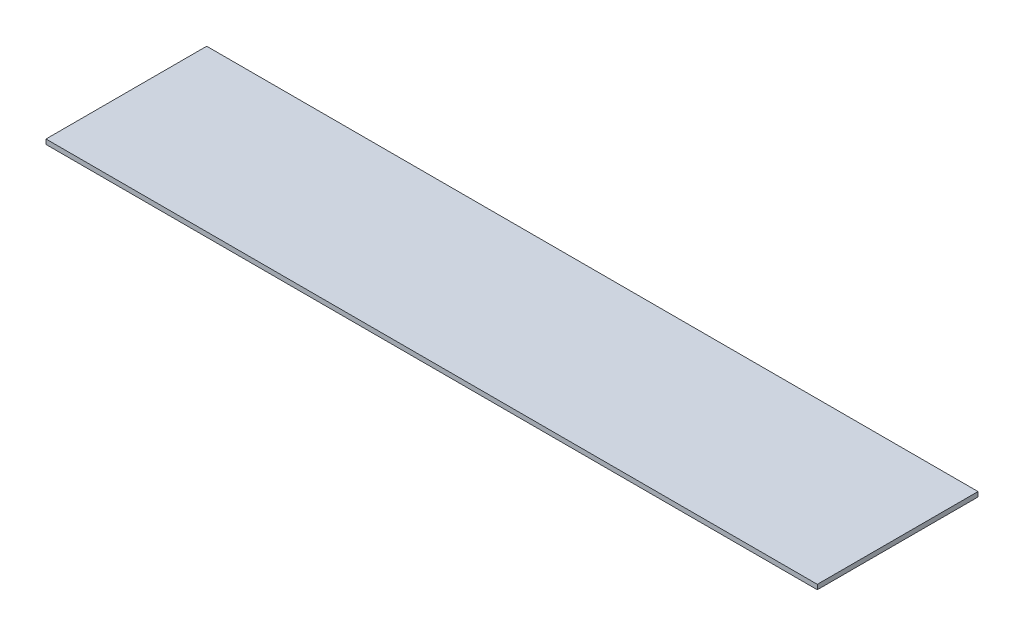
ISO-10303-21;
HEADER;
FILE_DESCRIPTION(('STEP AP214'),'2;1');
FILE_NAME('part.step','',(''),(''),'','','');
FILE_SCHEMA(('AUTOMOTIVE_DESIGN { 1 0 10303 214 1 1 1 1 }'));
ENDSEC;
DATA;
#1=APPLICATION_CONTEXT('core data for automotive mechanical design processes');
#2=APPLICATION_PROTOCOL_DEFINITION('international standard','automotive_design',2000,#1);
#3=PRODUCT_CONTEXT('',#1,'mechanical');
#4=PRODUCT('Part','Part','',(#3));
#5=PRODUCT_RELATED_PRODUCT_CATEGORY('part','',(#4));
#6=PRODUCT_DEFINITION_FORMATION('','',#4);
#7=PRODUCT_DEFINITION_CONTEXT('part definition',#1,'design');
#8=PRODUCT_DEFINITION('design','',#6,#7);
#9=PRODUCT_DEFINITION_SHAPE('','',#8);
#10=(LENGTH_UNIT() NAMED_UNIT(*) SI_UNIT(.MILLI.,.METRE.));
#11=(NAMED_UNIT(*) PLANE_ANGLE_UNIT() SI_UNIT($,.RADIAN.));
#12=(NAMED_UNIT(*) SI_UNIT($,.STERADIAN.) SOLID_ANGLE_UNIT());
#13=UNCERTAINTY_MEASURE_WITH_UNIT(LENGTH_MEASURE(1.E-05),#10,'distance_accuracy_value','');
#14=(GEOMETRIC_REPRESENTATION_CONTEXT(3) GLOBAL_UNCERTAINTY_ASSIGNED_CONTEXT((#13)) GLOBAL_UNIT_ASSIGNED_CONTEXT((#10,
#11,#12)) REPRESENTATION_CONTEXT('',''));
#15=CARTESIAN_POINT('',(0.,0.,0.));
#16=DIRECTION('',(0.,0.,1.));
#17=DIRECTION('',(1.,0.,0.));
#18=AXIS2_PLACEMENT_3D('',#15,#16,#17);
#19=CARTESIAN_POINT('',(0.,3.,0.));
#20=DIRECTION('',(1.,0.,0.));
#21=DIRECTION('',(0.,0.,-1.));
#22=AXIS2_PLACEMENT_3D('',#19,#20,#21);
#23=PLANE('',#22);
#24=DIRECTION('',(0.,0.,1.));
#25=VECTOR('',#24,1.);
#26=CARTESIAN_POINT('',(0.,0.,0.));
#27=LINE('',#26,#25);
#28=CARTESIAN_POINT('',(0.,0.,-101.6));
#29=VERTEX_POINT('',#28);
#30=CARTESIAN_POINT('',(0.,0.,0.));
#31=VERTEX_POINT('',#30);
#32=EDGE_CURVE('E96',#29,#31,#27,.T.);
#33=ORIENTED_EDGE('',*,*,#32,.T.);
#34=DIRECTION('',(0.,-1.,0.));
#35=VECTOR('',#34,1.);
#36=CARTESIAN_POINT('',(0.,3.,0.));
#37=LINE('',#36,#35);
#38=CARTESIAN_POINT('',(0.,3.,0.));
#39=VERTEX_POINT('',#38);
#40=EDGE_CURVE('E11',#39,#31,#37,.T.);
#41=ORIENTED_EDGE('',*,*,#40,.F.);
#42=DIRECTION('',(0.,0.,1.));
#43=VECTOR('',#42,1.);
#44=CARTESIAN_POINT('',(0.,3.,0.));
#45=LINE('',#44,#43);
#46=CARTESIAN_POINT('',(0.,3.,-101.6));
#47=VERTEX_POINT('',#46);
#48=EDGE_CURVE('E84',#47,#39,#45,.T.);
#49=ORIENTED_EDGE('',*,*,#48,.F.);
#50=DIRECTION('',(0.,-1.,0.));
#51=VECTOR('',#50,1.);
#52=CARTESIAN_POINT('',(0.,3.,-101.6));
#53=LINE('',#52,#51);
#54=EDGE_CURVE('E92',#47,#29,#53,.T.);
#55=ORIENTED_EDGE('',*,*,#54,.T.);
#56=EDGE_LOOP('',(#33,#41,#49,#55));
#57=FACE_BOUND('',#56,.T.);
#58=ADVANCED_FACE('F33',(#57),#23,.F.);
#59=CARTESIAN_POINT('',(0.,3.,0.));
#60=DIRECTION('',(0.,0.,-1.));
#61=DIRECTION('',(-1.,0.,0.));
#62=AXIS2_PLACEMENT_3D('',#59,#60,#61);
#63=PLANE('',#62);
#64=DIRECTION('',(1.,0.,0.));
#65=VECTOR('',#64,1.);
#66=CARTESIAN_POINT('',(0.,0.,0.));
#67=LINE('',#66,#65);
#68=CARTESIAN_POINT('',(487.68,0.,0.));
#69=VERTEX_POINT('',#68);
#70=EDGE_CURVE('E88',#31,#69,#67,.T.);
#71=ORIENTED_EDGE('',*,*,#70,.T.);
#72=DIRECTION('',(0.,-1.,0.));
#73=VECTOR('',#72,1.);
#74=CARTESIAN_POINT('',(487.68,3.,0.));
#75=LINE('',#74,#73);
#76=CARTESIAN_POINT('',(487.68,3.,0.));
#77=VERTEX_POINT('',#76);
#78=EDGE_CURVE('E41',#77,#69,#75,.T.);
#79=ORIENTED_EDGE('',*,*,#78,.F.);
#80=DIRECTION('',(1.,0.,0.));
#81=VECTOR('',#80,1.);
#82=CARTESIAN_POINT('',(0.,3.,0.));
#83=LINE('',#82,#81);
#84=EDGE_CURVE('E79',#39,#77,#83,.T.);
#85=ORIENTED_EDGE('',*,*,#84,.F.);
#86=ORIENTED_EDGE('',*,*,#40,.T.);
#87=EDGE_LOOP('',(#71,#79,#85,#86));
#88=FACE_BOUND('',#87,.T.);
#89=ADVANCED_FACE('F87',(#88),#63,.F.);
#90=CARTESIAN_POINT('',(487.68,3.,0.));
#91=DIRECTION('',(-1.,0.,0.));
#92=DIRECTION('',(0.,0.,1.));
#93=AXIS2_PLACEMENT_3D('',#90,#91,#92);
#94=PLANE('',#93);
#95=DIRECTION('',(0.,0.,-1.));
#96=VECTOR('',#95,1.);
#97=CARTESIAN_POINT('',(487.68,0.,0.));
#98=LINE('',#97,#96);
#99=CARTESIAN_POINT('',(487.68,0.,-101.6));
#100=VERTEX_POINT('',#99);
#101=EDGE_CURVE('E66',#69,#100,#98,.T.);
#102=ORIENTED_EDGE('',*,*,#101,.T.);
#103=DIRECTION('',(0.,-1.,0.));
#104=VECTOR('',#103,1.);
#105=CARTESIAN_POINT('',(487.68,3.,-101.6));
#106=LINE('',#105,#104);
#107=CARTESIAN_POINT('',(487.68,3.,-101.6));
#108=VERTEX_POINT('',#107);
#109=EDGE_CURVE('E89',#108,#100,#106,.T.);
#110=ORIENTED_EDGE('',*,*,#109,.F.);
#111=DIRECTION('',(0.,0.,-1.));
#112=VECTOR('',#111,1.);
#113=CARTESIAN_POINT('',(487.68,3.,0.));
#114=LINE('',#113,#112);
#115=EDGE_CURVE('E82',#77,#108,#114,.T.);
#116=ORIENTED_EDGE('',*,*,#115,.F.);
#117=ORIENTED_EDGE('',*,*,#78,.T.);
#118=EDGE_LOOP('',(#102,#110,#116,#117));
#119=FACE_BOUND('',#118,.T.);
#120=ADVANCED_FACE('F90',(#119),#94,.F.);
#121=CARTESIAN_POINT('',(0.,3.,-101.6));
#122=DIRECTION('',(0.,0.,1.));
#123=DIRECTION('',(1.,0.,0.));
#124=AXIS2_PLACEMENT_3D('',#121,#122,#123);
#125=PLANE('',#124);
#126=DIRECTION('',(-1.,0.,0.));
#127=VECTOR('',#126,1.);
#128=CARTESIAN_POINT('',(0.,0.,-101.6));
#129=LINE('',#128,#127);
#130=EDGE_CURVE('E72',#100,#29,#129,.T.);
#131=ORIENTED_EDGE('',*,*,#130,.T.);
#132=ORIENTED_EDGE('',*,*,#54,.F.);
#133=DIRECTION('',(-1.,0.,0.));
#134=VECTOR('',#133,1.);
#135=CARTESIAN_POINT('',(0.,3.,-101.6));
#136=LINE('',#135,#134);
#137=EDGE_CURVE('E49',#108,#47,#136,.T.);
#138=ORIENTED_EDGE('',*,*,#137,.F.);
#139=ORIENTED_EDGE('',*,*,#109,.T.);
#140=EDGE_LOOP('',(#131,#132,#138,#139));
#141=FACE_BOUND('',#140,.T.);
#142=ADVANCED_FACE('F103',(#141),#125,.F.);
#143=CARTESIAN_POINT('',(0.,3.,0.));
#144=DIRECTION('',(0.,-1.,0.));
#145=DIRECTION('',(0.,0.,-1.));
#146=AXIS2_PLACEMENT_3D('',#143,#144,#145);
#147=PLANE('',#146);
#148=ORIENTED_EDGE('',*,*,#48,.T.);
#149=ORIENTED_EDGE('',*,*,#84,.T.);
#150=ORIENTED_EDGE('',*,*,#115,.T.);
#151=ORIENTED_EDGE('',*,*,#137,.T.);
#152=EDGE_LOOP('',(#148,#149,#150,#151));
#153=FACE_BOUND('',#152,.T.);
#154=ADVANCED_FACE('F80',(#153),#147,.F.);
#155=CARTESIAN_POINT('',(0.,0.,0.));
#156=DIRECTION('',(0.,-1.,0.));
#157=DIRECTION('',(0.,0.,-1.));
#158=AXIS2_PLACEMENT_3D('',#155,#156,#157);
#159=PLANE('',#158);
#160=ORIENTED_EDGE('',*,*,#32,.F.);
#161=ORIENTED_EDGE('',*,*,#130,.F.);
#162=ORIENTED_EDGE('',*,*,#101,.F.);
#163=ORIENTED_EDGE('',*,*,#70,.F.);
#164=EDGE_LOOP('',(#160,#161,#162,#163));
#165=FACE_BOUND('',#164,.T.);
#166=ADVANCED_FACE('F106',(#165),#159,.T.);
#167=CLOSED_SHELL('',(#58,#89,#120,#142,#154,#166));
#168=MANIFOLD_SOLID_BREP('B2',#167);
#169=ADVANCED_BREP_SHAPE_REPRESENTATION('',(#18,#168),#14);
#170=SHAPE_DEFINITION_REPRESENTATION(#9,#169);
ENDSEC;
END-ISO-10303-21;
